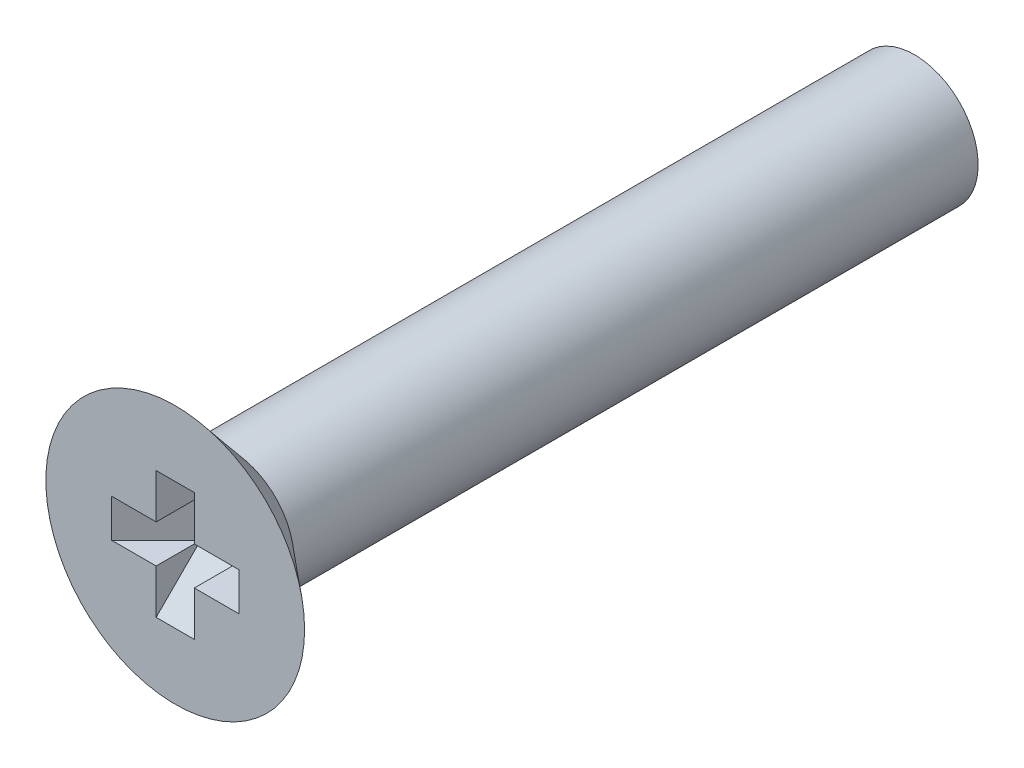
ISO-10303-21;
HEADER;
FILE_DESCRIPTION(('STEP AP214'),'2;1');
FILE_NAME('part.step','',(''),(''),'','','');
FILE_SCHEMA(('AUTOMOTIVE_DESIGN { 1 0 10303 214 1 1 1 1 }'));
ENDSEC;
DATA;
#1=APPLICATION_CONTEXT('core data for automotive mechanical design processes');
#2=APPLICATION_PROTOCOL_DEFINITION('international standard','automotive_design',2000,#1);
#3=PRODUCT_CONTEXT('',#1,'mechanical');
#4=PRODUCT('Part','Part','',(#3));
#5=PRODUCT_RELATED_PRODUCT_CATEGORY('part','',(#4));
#6=PRODUCT_DEFINITION_FORMATION('','',#4);
#7=PRODUCT_DEFINITION_CONTEXT('part definition',#1,'design');
#8=PRODUCT_DEFINITION('design','',#6,#7);
#9=PRODUCT_DEFINITION_SHAPE('','',#8);
#10=(LENGTH_UNIT() NAMED_UNIT(*) SI_UNIT(.MILLI.,.METRE.));
#11=(NAMED_UNIT(*) PLANE_ANGLE_UNIT() SI_UNIT($,.RADIAN.));
#12=(NAMED_UNIT(*) SI_UNIT($,.STERADIAN.) SOLID_ANGLE_UNIT());
#13=UNCERTAINTY_MEASURE_WITH_UNIT(LENGTH_MEASURE(1.E-05),#10,'distance_accuracy_value','');
#14=(GEOMETRIC_REPRESENTATION_CONTEXT(3) GLOBAL_UNCERTAINTY_ASSIGNED_CONTEXT((#13)) GLOBAL_UNIT_ASSIGNED_CONTEXT((#10,
#11,#12)) REPRESENTATION_CONTEXT('',''));
#15=CARTESIAN_POINT('',(0.,0.,0.));
#16=DIRECTION('',(0.,0.,1.));
#17=DIRECTION('',(1.,0.,0.));
#18=AXIS2_PLACEMENT_3D('',#15,#16,#17);
#19=CARTESIAN_POINT('',(-0.32766,-0.327659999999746,-0.76454));
#20=DIRECTION('',(0.,0.,-1.));
#21=DIRECTION('',(-1.,0.,0.));
#22=AXIS2_PLACEMENT_3D('',#19,#20,#21);
#23=PLANE('',#22);
#24=DIRECTION('',(0.,1.,0.));
#25=VECTOR('',#24,1.);
#26=CARTESIAN_POINT('',(0.32766,-0.32766,-0.76454));
#27=LINE('',#26,#25);
#28=CARTESIAN_POINT('',(0.32766,-0.327659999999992,-0.764539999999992));
#29=VERTEX_POINT('',#28);
#30=CARTESIAN_POINT('',(0.32766,0.327660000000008,-0.764540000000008));
#31=VERTEX_POINT('',#30);
#32=EDGE_CURVE('E80',#29,#31,#27,.T.);
#33=ORIENTED_EDGE('',*,*,#32,.T.);
#34=DIRECTION('',(1.,0.,0.));
#35=VECTOR('',#34,1.);
#36=CARTESIAN_POINT('',(-0.32766,0.327660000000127,-0.764540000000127));
#37=LINE('',#36,#35);
#38=CARTESIAN_POINT('',(-0.32766,0.327660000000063,-0.764540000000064));
#39=VERTEX_POINT('',#38);
#40=EDGE_CURVE('E167',#31,#39,#37,.F.);
#41=ORIENTED_EDGE('',*,*,#40,.T.);
#42=DIRECTION('',(0.,1.,0.));
#43=VECTOR('',#42,1.);
#44=CARTESIAN_POINT('',(-0.32766,-0.32766,-0.76454));
#45=LINE('',#44,#43);
#46=CARTESIAN_POINT('',(-0.32766,-0.327659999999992,-0.764539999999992));
#47=VERTEX_POINT('',#46);
#48=EDGE_CURVE('E107',#39,#47,#45,.F.);
#49=ORIENTED_EDGE('',*,*,#48,.T.);
#50=DIRECTION('',(1.,0.,0.));
#51=VECTOR('',#50,1.);
#52=CARTESIAN_POINT('',(-0.32766,-0.327659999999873,-0.764539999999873));
#53=LINE('',#52,#51);
#54=EDGE_CURVE('E104',#47,#29,#53,.T.);
#55=ORIENTED_EDGE('',*,*,#54,.T.);
#56=EDGE_LOOP('',(#33,#41,#49,#55));
#57=FACE_BOUND('',#56,.T.);
#58=ADVANCED_FACE('F17',(#57),#23,.F.);
#59=CARTESIAN_POINT('',(0.,-0.32766,0.));
#60=DIRECTION('',(0.,1.,0.));
#61=DIRECTION('',(0.,0.,1.));
#62=AXIS2_PLACEMENT_3D('',#59,#60,#61);
#63=PLANE('',#62);
#64=DIRECTION('',(0.,0.,-1.));
#65=VECTOR('',#64,1.);
#66=CARTESIAN_POINT('',(0.32766,-0.32766,0.));
#67=LINE('',#66,#65);
#68=CARTESIAN_POINT('',(0.32766,-0.32766,0.));
#69=VERTEX_POINT('',#68);
#70=EDGE_CURVE('E88',#29,#69,#67,.F.);
#71=ORIENTED_EDGE('',*,*,#70,.T.);
#72=DIRECTION('',(-1.,0.,0.));
#73=VECTOR('',#72,1.);
#74=CARTESIAN_POINT('',(0.,-0.32766,0.));
#75=LINE('',#74,#73);
#76=CARTESIAN_POINT('',(1.0922,-0.32766,0.));
#77=VERTEX_POINT('',#76);
#78=EDGE_CURVE('E91',#69,#77,#75,.F.);
#79=ORIENTED_EDGE('',*,*,#78,.T.);
#80=DIRECTION('',(-0.707106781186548,0.,-0.707106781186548));
#81=VECTOR('',#80,1.);
#82=CARTESIAN_POINT('',(1.0922,-0.32766,0.));
#83=LINE('',#82,#81);
#84=EDGE_CURVE('E85',#77,#29,#83,.T.);
#85=ORIENTED_EDGE('',*,*,#84,.T.);
#86=EDGE_LOOP('',(#71,#79,#85));
#87=FACE_BOUND('',#86,.T.);
#88=ADVANCED_FACE('F87',(#87),#63,.T.);
#89=CARTESIAN_POINT('',(1.0922,-0.32766,0.));
#90=DIRECTION('',(0.707106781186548,0.,-0.707106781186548));
#91=DIRECTION('',(-0.707106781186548,0.,-0.707106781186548));
#92=AXIS2_PLACEMENT_3D('',#89,#90,#91);
#93=PLANE('',#92);
#94=ORIENTED_EDGE('',*,*,#32,.F.);
#95=ORIENTED_EDGE('',*,*,#84,.F.);
#96=DIRECTION('',(0.,1.,0.));
#97=VECTOR('',#96,1.);
#98=CARTESIAN_POINT('',(1.0922,0.,0.));
#99=LINE('',#98,#97);
#100=CARTESIAN_POINT('',(1.0922,0.32766,0.));
#101=VERTEX_POINT('',#100);
#102=EDGE_CURVE('E144',#77,#101,#99,.T.);
#103=ORIENTED_EDGE('',*,*,#102,.T.);
#104=DIRECTION('',(-0.707106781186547,0.,-0.707106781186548));
#105=VECTOR('',#104,1.);
#106=CARTESIAN_POINT('',(1.0922,0.32766,0.));
#107=LINE('',#106,#105);
#108=EDGE_CURVE('E113',#101,#31,#107,.T.);
#109=ORIENTED_EDGE('',*,*,#108,.T.);
#110=EDGE_LOOP('',(#94,#95,#103,#109));
#111=FACE_BOUND('',#110,.T.);
#112=ADVANCED_FACE('F111',(#111),#93,.F.);
#113=CARTESIAN_POINT('',(0.,0.32766,0.));
#114=DIRECTION('',(0.,1.,0.));
#115=DIRECTION('',(0.,0.,1.));
#116=AXIS2_PLACEMENT_3D('',#113,#114,#115);
#117=PLANE('',#116);
#118=ORIENTED_EDGE('',*,*,#108,.F.);
#119=DIRECTION('',(-1.,0.,0.));
#120=VECTOR('',#119,1.);
#121=CARTESIAN_POINT('',(0.,0.32766,0.));
#122=LINE('',#121,#120);
#123=CARTESIAN_POINT('',(0.32766,0.32766,0.));
#124=VERTEX_POINT('',#123);
#125=EDGE_CURVE('E142',#101,#124,#122,.T.);
#126=ORIENTED_EDGE('',*,*,#125,.T.);
#127=DIRECTION('',(0.,0.,-1.));
#128=VECTOR('',#127,1.);
#129=CARTESIAN_POINT('',(0.32766,0.32766,0.));
#130=LINE('',#129,#128);
#131=EDGE_CURVE('E116',#124,#31,#130,.T.);
#132=ORIENTED_EDGE('',*,*,#131,.T.);
#133=EDGE_LOOP('',(#118,#126,#132));
#134=FACE_BOUND('',#133,.T.);
#135=ADVANCED_FACE('F170',(#134),#117,.F.);
#136=CARTESIAN_POINT('',(0.32766,0.,0.));
#137=DIRECTION('',(1.,0.,0.));
#138=DIRECTION('',(0.,0.,-1.));
#139=AXIS2_PLACEMENT_3D('',#136,#137,#138);
#140=PLANE('',#139);
#141=DIRECTION('',(0.,0.707106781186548,0.707106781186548));
#142=VECTOR('',#141,1.);
#143=CARTESIAN_POINT('',(0.32766,0.327660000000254,-0.76454));
#144=LINE('',#143,#142);
#145=CARTESIAN_POINT('',(0.32766,1.09220000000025,0.));
#146=VERTEX_POINT('',#145);
#147=EDGE_CURVE('E164',#146,#31,#144,.F.);
#148=ORIENTED_EDGE('',*,*,#147,.T.);
#149=ORIENTED_EDGE('',*,*,#131,.F.);
#150=DIRECTION('',(0.,1.,0.));
#151=VECTOR('',#150,1.);
#152=CARTESIAN_POINT('',(0.32766,0.,0.));
#153=LINE('',#152,#151);
#154=EDGE_CURVE('E140',#124,#146,#153,.T.);
#155=ORIENTED_EDGE('',*,*,#154,.T.);
#156=EDGE_LOOP('',(#148,#149,#155));
#157=FACE_BOUND('',#156,.T.);
#158=ADVANCED_FACE('F176',(#157),#140,.F.);
#159=CARTESIAN_POINT('',(-0.32766,0.327660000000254,-0.76454));
#160=DIRECTION('',(0.,0.707106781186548,-0.707106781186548));
#161=DIRECTION('',(0.,0.707106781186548,0.707106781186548));
#162=AXIS2_PLACEMENT_3D('',#159,#160,#161);
#163=PLANE('',#162);
#164=DIRECTION('',(-1.,0.,0.));
#165=VECTOR('',#164,1.);
#166=CARTESIAN_POINT('',(0.,1.09220000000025,0.));
#167=LINE('',#166,#165);
#168=CARTESIAN_POINT('',(-0.32766,1.09220000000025,0.));
#169=VERTEX_POINT('',#168);
#170=EDGE_CURVE('E138',#146,#169,#167,.T.);
#171=ORIENTED_EDGE('',*,*,#170,.T.);
#172=DIRECTION('',(0.,0.707106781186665,0.70710678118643));
#173=VECTOR('',#172,1.);
#174=CARTESIAN_POINT('',(-0.32766,0.32766,-0.76454));
#175=LINE('',#174,#173);
#176=EDGE_CURVE('E161',#39,#169,#175,.T.);
#177=ORIENTED_EDGE('',*,*,#176,.F.);
#178=ORIENTED_EDGE('',*,*,#40,.F.);
#179=ORIENTED_EDGE('',*,*,#147,.F.);
#180=EDGE_LOOP('',(#171,#177,#178,#179));
#181=FACE_BOUND('',#180,.T.);
#182=ADVANCED_FACE('F180',(#181),#163,.F.);
#183=CARTESIAN_POINT('',(-0.32766,0.,0.));
#184=DIRECTION('',(1.,0.,0.));
#185=DIRECTION('',(0.,0.,-1.));
#186=AXIS2_PLACEMENT_3D('',#183,#184,#185);
#187=PLANE('',#186);
#188=DIRECTION('',(0.,1.,0.));
#189=VECTOR('',#188,1.);
#190=CARTESIAN_POINT('',(-0.32766,0.,0.));
#191=LINE('',#190,#189);
#192=CARTESIAN_POINT('',(-0.32766,0.32766,0.));
#193=VERTEX_POINT('',#192);
#194=EDGE_CURVE('E136',#169,#193,#191,.F.);
#195=ORIENTED_EDGE('',*,*,#194,.T.);
#196=DIRECTION('',(0.,0.,1.));
#197=VECTOR('',#196,1.);
#198=CARTESIAN_POINT('',(-0.32766,0.32766,0.));
#199=LINE('',#198,#197);
#200=EDGE_CURVE('E158',#193,#39,#199,.F.);
#201=ORIENTED_EDGE('',*,*,#200,.T.);
#202=ORIENTED_EDGE('',*,*,#176,.T.);
#203=EDGE_LOOP('',(#195,#201,#202));
#204=FACE_BOUND('',#203,.T.);
#205=ADVANCED_FACE('F184',(#204),#187,.T.);
#206=CARTESIAN_POINT('',(0.,0.32766,0.));
#207=DIRECTION('',(0.,1.,0.));
#208=DIRECTION('',(0.,0.,1.));
#209=AXIS2_PLACEMENT_3D('',#206,#207,#208);
#210=PLANE('',#209);
#211=ORIENTED_EDGE('',*,*,#200,.F.);
#212=DIRECTION('',(-1.,0.,0.));
#213=VECTOR('',#212,1.);
#214=CARTESIAN_POINT('',(0.,0.32766,0.));
#215=LINE('',#214,#213);
#216=CARTESIAN_POINT('',(-1.0922,0.32766,0.));
#217=VERTEX_POINT('',#216);
#218=EDGE_CURVE('E134',#193,#217,#215,.T.);
#219=ORIENTED_EDGE('',*,*,#218,.T.);
#220=DIRECTION('',(-0.707106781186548,0.,0.707106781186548));
#221=VECTOR('',#220,1.);
#222=CARTESIAN_POINT('',(-0.32766,0.32766,-0.76454));
#223=LINE('',#222,#221);
#224=EDGE_CURVE('E155',#217,#39,#223,.F.);
#225=ORIENTED_EDGE('',*,*,#224,.T.);
#226=EDGE_LOOP('',(#211,#219,#225));
#227=FACE_BOUND('',#226,.T.);
#228=ADVANCED_FACE('F188',(#227),#210,.F.);
#229=CARTESIAN_POINT('',(-0.32766,-0.32766,-0.76454));
#230=DIRECTION('',(-0.707106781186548,0.,-0.707106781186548));
#231=DIRECTION('',(-0.707106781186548,0.,0.707106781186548));
#232=AXIS2_PLACEMENT_3D('',#229,#230,#231);
#233=PLANE('',#232);
#234=ORIENTED_EDGE('',*,*,#48,.F.);
#235=ORIENTED_EDGE('',*,*,#224,.F.);
#236=DIRECTION('',(0.,1.,0.));
#237=VECTOR('',#236,1.);
#238=CARTESIAN_POINT('',(-1.0922,0.,0.));
#239=LINE('',#238,#237);
#240=CARTESIAN_POINT('',(-1.0922,-0.32766,0.));
#241=VERTEX_POINT('',#240);
#242=EDGE_CURVE('E132',#217,#241,#239,.F.);
#243=ORIENTED_EDGE('',*,*,#242,.T.);
#244=DIRECTION('',(-0.707106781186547,0.,0.707106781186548));
#245=VECTOR('',#244,1.);
#246=CARTESIAN_POINT('',(-0.32766,-0.32766,-0.76454));
#247=LINE('',#246,#245);
#248=EDGE_CURVE('E151',#47,#241,#247,.T.);
#249=ORIENTED_EDGE('',*,*,#248,.F.);
#250=EDGE_LOOP('',(#234,#235,#243,#249));
#251=FACE_BOUND('',#250,.T.);
#252=ADVANCED_FACE('F191',(#251),#233,.F.);
#253=CARTESIAN_POINT('',(0.,-0.32766,0.));
#254=DIRECTION('',(0.,1.,0.));
#255=DIRECTION('',(0.,0.,1.));
#256=AXIS2_PLACEMENT_3D('',#253,#254,#255);
#257=PLANE('',#256);
#258=ORIENTED_EDGE('',*,*,#248,.T.);
#259=DIRECTION('',(-1.,0.,0.));
#260=VECTOR('',#259,1.);
#261=CARTESIAN_POINT('',(0.,-0.32766,0.));
#262=LINE('',#261,#260);
#263=CARTESIAN_POINT('',(-0.32766,-0.32766,0.));
#264=VERTEX_POINT('',#263);
#265=EDGE_CURVE('E130',#241,#264,#262,.F.);
#266=ORIENTED_EDGE('',*,*,#265,.T.);
#267=DIRECTION('',(0.,0.,-1.));
#268=VECTOR('',#267,1.);
#269=CARTESIAN_POINT('',(-0.32766,-0.32766,0.));
#270=LINE('',#269,#268);
#271=EDGE_CURVE('E109',#47,#264,#270,.F.);
#272=ORIENTED_EDGE('',*,*,#271,.F.);
#273=EDGE_LOOP('',(#258,#266,#272));
#274=FACE_BOUND('',#273,.T.);
#275=ADVANCED_FACE('F195',(#274),#257,.T.);
#276=CARTESIAN_POINT('',(-0.32766,0.,0.));
#277=DIRECTION('',(1.,0.,0.));
#278=DIRECTION('',(0.,0.,-1.));
#279=AXIS2_PLACEMENT_3D('',#276,#277,#278);
#280=PLANE('',#279);
#281=DIRECTION('',(0.,0.707106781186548,-0.707106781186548));
#282=VECTOR('',#281,1.);
#283=CARTESIAN_POINT('',(-0.32766,-1.09219999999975,0.));
#284=LINE('',#283,#282);
#285=CARTESIAN_POINT('',(-0.32766,-1.09219999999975,0.));
#286=VERTEX_POINT('',#285);
#287=EDGE_CURVE('E100',#286,#47,#284,.T.);
#288=ORIENTED_EDGE('',*,*,#287,.T.);
#289=ORIENTED_EDGE('',*,*,#271,.T.);
#290=DIRECTION('',(0.,1.,0.));
#291=VECTOR('',#290,1.);
#292=CARTESIAN_POINT('',(-0.32766,0.,0.));
#293=LINE('',#292,#291);
#294=EDGE_CURVE('E126',#264,#286,#293,.F.);
#295=ORIENTED_EDGE('',*,*,#294,.T.);
#296=EDGE_LOOP('',(#288,#289,#295));
#297=FACE_BOUND('',#296,.T.);
#298=ADVANCED_FACE('F198',(#297),#280,.T.);
#299=CARTESIAN_POINT('',(-0.32766,-1.09219999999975,0.));
#300=DIRECTION('',(0.,-0.707106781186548,-0.707106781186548));
#301=DIRECTION('',(0.,0.707106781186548,-0.707106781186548));
#302=AXIS2_PLACEMENT_3D('',#299,#300,#301);
#303=PLANE('',#302);
#304=DIRECTION('',(-1.,0.,0.));
#305=VECTOR('',#304,1.);
#306=CARTESIAN_POINT('',(0.,-1.09219999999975,0.));
#307=LINE('',#306,#305);
#308=CARTESIAN_POINT('',(0.32766,-1.09219999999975,0.));
#309=VERTEX_POINT('',#308);
#310=EDGE_CURVE('E35',#286,#309,#307,.F.);
#311=ORIENTED_EDGE('',*,*,#310,.T.);
#312=DIRECTION('',(0.,0.70710678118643,-0.707106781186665));
#313=VECTOR('',#312,1.);
#314=CARTESIAN_POINT('',(0.32766,-1.09219999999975,0.));
#315=LINE('',#314,#313);
#316=EDGE_CURVE('E97',#309,#29,#315,.T.);
#317=ORIENTED_EDGE('',*,*,#316,.T.);
#318=ORIENTED_EDGE('',*,*,#54,.F.);
#319=ORIENTED_EDGE('',*,*,#287,.F.);
#320=EDGE_LOOP('',(#311,#317,#318,#319));
#321=FACE_BOUND('',#320,.T.);
#322=ADVANCED_FACE('F103',(#321),#303,.F.);
#323=CARTESIAN_POINT('',(0.32766,0.,0.));
#324=DIRECTION('',(1.,0.,0.));
#325=DIRECTION('',(0.,0.,-1.));
#326=AXIS2_PLACEMENT_3D('',#323,#324,#325);
#327=PLANE('',#326);
#328=DIRECTION('',(0.,1.,0.));
#329=VECTOR('',#328,1.);
#330=CARTESIAN_POINT('',(0.32766,0.,0.));
#331=LINE('',#330,#329);
#332=EDGE_CURVE('E99',#309,#69,#331,.T.);
#333=ORIENTED_EDGE('',*,*,#332,.T.);
#334=ORIENTED_EDGE('',*,*,#70,.F.);
#335=ORIENTED_EDGE('',*,*,#316,.F.);
#336=EDGE_LOOP('',(#333,#334,#335));
#337=FACE_BOUND('',#336,.T.);
#338=ADVANCED_FACE('F96',(#337),#327,.F.);
#339=CARTESIAN_POINT('',(0.,0.,0.));
#340=DIRECTION('',(0.,0.,-1.));
#341=DIRECTION('',(-1.,0.,0.));
#342=AXIS2_PLACEMENT_3D('',#339,#340,#341);
#343=PLANE('',#342);
#344=ORIENTED_EDGE('',*,*,#310,.F.);
#345=ORIENTED_EDGE('',*,*,#294,.F.);
#346=ORIENTED_EDGE('',*,*,#265,.F.);
#347=ORIENTED_EDGE('',*,*,#242,.F.);
#348=ORIENTED_EDGE('',*,*,#218,.F.);
#349=ORIENTED_EDGE('',*,*,#194,.F.);
#350=ORIENTED_EDGE('',*,*,#170,.F.);
#351=ORIENTED_EDGE('',*,*,#154,.F.);
#352=ORIENTED_EDGE('',*,*,#125,.F.);
#353=ORIENTED_EDGE('',*,*,#102,.F.);
#354=ORIENTED_EDGE('',*,*,#78,.F.);
#355=ORIENTED_EDGE('',*,*,#332,.F.);
#356=EDGE_LOOP('',(#344,#345,#346,#347,#348,#349,#350,#351,#352,#353,#354,#355));
#357=FACE_BOUND('',#356,.T.);
#358=CARTESIAN_POINT('',(0.,0.,2.94050376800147E-11));
#359=DIRECTION('',(0.,0.,1.));
#360=DIRECTION('',(1.,0.,0.));
#361=AXIS2_PLACEMENT_3D('',#358,#359,#360);
#362=CIRCLE('',#361,2.22250000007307);
#363=CARTESIAN_POINT('',(2.22250000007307,0.,2.94050376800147E-11));
#364=VERTEX_POINT('',#363);
#365=EDGE_CURVE('E20',#364,#364,#362,.F.);
#366=ORIENTED_EDGE('',*,*,#365,.F.);
#367=EDGE_LOOP('',(#366));
#368=FACE_BOUND('',#367,.T.);
#369=ADVANCED_FACE('F200',(#357,#368),#343,.F.);
#370=CARTESIAN_POINT('',(0.,0.,-12.7));
#371=DIRECTION('',(0.,0.,-1.));
#372=DIRECTION('',(-1.,0.,0.));
#373=AXIS2_PLACEMENT_3D('',#370,#371,#372);
#374=PLANE('',#373);
#375=CARTESIAN_POINT('',(0.,0.,-12.7));
#376=DIRECTION('',(0.,0.,-1.));
#377=DIRECTION('',(-1.,0.,0.));
#378=AXIS2_PLACEMENT_3D('',#375,#376,#377);
#379=CIRCLE('',#378,1.0922);
#380=CARTESIAN_POINT('',(-1.0922,0.,-12.7));
#381=VERTEX_POINT('',#380);
#382=EDGE_CURVE('E26',#381,#381,#379,.F.);
#383=ORIENTED_EDGE('',*,*,#382,.F.);
#384=EDGE_LOOP('',(#383));
#385=FACE_BOUND('',#384,.T.);
#386=ADVANCED_FACE('F203',(#385),#374,.T.);
#387=CARTESIAN_POINT('',(0.,0.,-1.13686837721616E-10));
#388=DIRECTION('',(0.,0.,1.));
#389=DIRECTION('',(1.,0.,0.));
#390=AXIS2_PLACEMENT_3D('',#387,#388,#389);
#391=CONICAL_SURFACE('',#390,2.22249999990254,0.87266462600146);
#392=ORIENTED_EDGE('',*,*,#365,.T.);
#393=EDGE_LOOP('',(#392));
#394=FACE_BOUND('',#393,.T.);
#395=CARTESIAN_POINT('',(0.,0.,-0.948434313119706));
#396=DIRECTION('',(0.,0.,-1.));
#397=DIRECTION('',(-1.,0.,0.));
#398=AXIS2_PLACEMENT_3D('',#395,#396,#397);
#399=CIRCLE('',#398,1.0922);
#400=CARTESIAN_POINT('',(-1.0922,0.,-0.948434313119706));
#401=VERTEX_POINT('',#400);
#402=EDGE_CURVE('E11',#401,#401,#399,.T.);
#403=ORIENTED_EDGE('',*,*,#402,.F.);
#404=EDGE_LOOP('',(#403));
#405=FACE_BOUND('',#404,.T.);
#406=ADVANCED_FACE('F210',(#394,#405),#391,.T.);
#407=CARTESIAN_POINT('',(0.,0.,0.635));
#408=DIRECTION('',(0.,0.,-1.));
#409=DIRECTION('',(-1.,0.,0.));
#410=AXIS2_PLACEMENT_3D('',#407,#408,#409);
#411=CYLINDRICAL_SURFACE('',#410,1.0922);
#412=ORIENTED_EDGE('',*,*,#402,.T.);
#413=EDGE_LOOP('',(#412));
#414=FACE_BOUND('',#413,.T.);
#415=ORIENTED_EDGE('',*,*,#382,.T.);
#416=EDGE_LOOP('',(#415));
#417=FACE_BOUND('',#416,.T.);
#418=ADVANCED_FACE('F214',(#414,#417),#411,.T.);
#419=CLOSED_SHELL('',(#58,#88,#112,#135,#158,#182,#205,#228,#252,#275,#298,#322,#338,#369,#386,
#406,#418));
#420=MANIFOLD_SOLID_BREP('B1',#419);
#421=ADVANCED_BREP_SHAPE_REPRESENTATION('',(#18,#420),#14);
#422=SHAPE_DEFINITION_REPRESENTATION(#9,#421);
ENDSEC;
END-ISO-10303-21;
